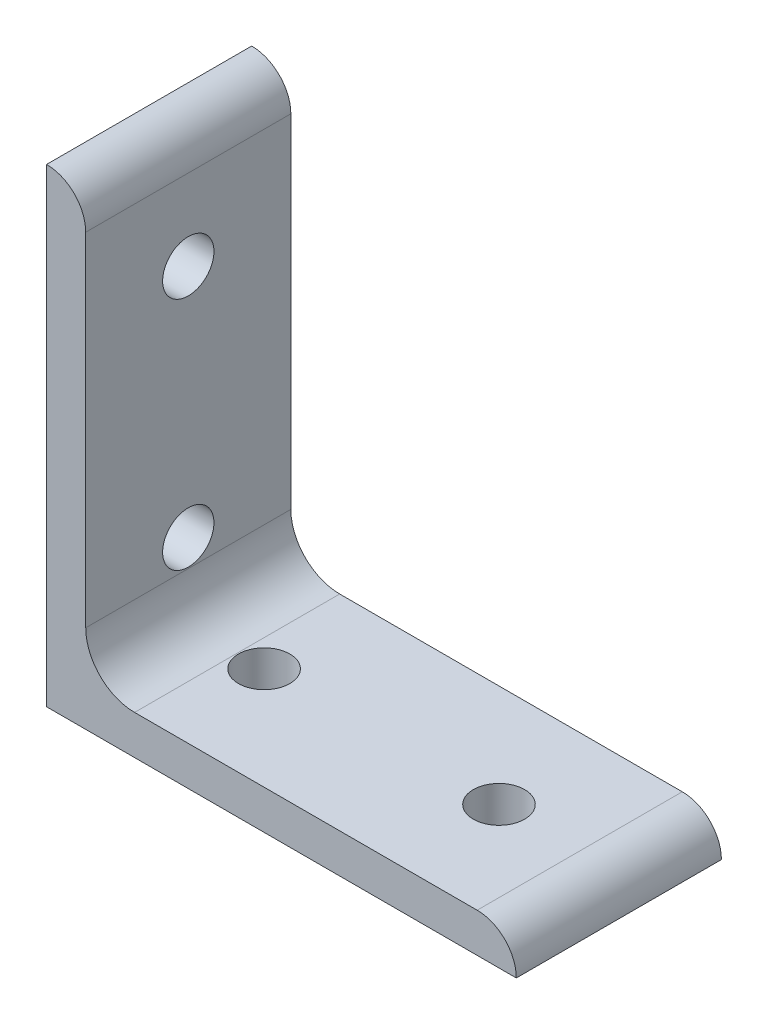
from build123d import *

# Parameters (mm, degrees)
BOSS_EXTRUDE1_DEPTH = 16.637
SKETCH2_R           = 4.1656
CUT_EXTRUDE1_DEPTH  = 110.03976233
SKETCH3_R           = 4.1656
CUT_EXTRUDE2_DEPTH  = 110.03976233


with BuildPart() as part:
    # Sketch1 → Boss-Extrude1 (new, symmetric)
    with BuildSketch(Plane.XY):
        with BuildLine():
            Line((0, 0), (0, 76.2))
            ThreePointArc((0, 76.2), (4.490128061, 74.340128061), (6.35, 69.85))
            Line((6.35, 69.85), (6.35, 14.2748))
            ThreePointArc((6.35, 14.2748), (8.67112018, 8.67112018), (14.2748, 6.35))
            Line((14.2748, 6.35), (69.85, 6.35))
            ThreePointArc((69.85, 6.35), (74.340128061, 4.490128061), (76.2, 0))
            Line((76.2, 0), (0, 0))
        make_face()
    extrude(amount=BOSS_EXTRUDE1_DEPTH, both=True)

    # Sketch2 → Cut-Extrude1 (cut, through all)
    with BuildSketch(Plane(origin=(0, 0, 0), x_dir=(1, 0, 0), z_dir=(0, 1, 0))):
        with Locations(Location((18.653125, 0, 0), (0, 0, 90))):
            Circle(SKETCH2_R)
        with Locations(Location((56.753125, 0, 0), (0, 0, 90))):
            Circle(SKETCH2_R)
    extrude(amount=CUT_EXTRUDE1_DEPTH, mode=Mode.SUBTRACT)

    # Sketch3 → Cut-Extrude2 (cut, through all)
    with BuildSketch(Plane(origin=(0, 0, 0), x_dir=(0, 0, -1), z_dir=(1, 0, 0))):
        with Locations(Location((0, 18.653125, 0), (0, 0, 270))):
            Circle(SKETCH3_R)
        with Locations(Location((0, 56.753125, 0), (0, 0, 270))):
            Circle(SKETCH3_R)
    extrude(amount=CUT_EXTRUDE2_DEPTH, mode=Mode.SUBTRACT)


solid = part.part
